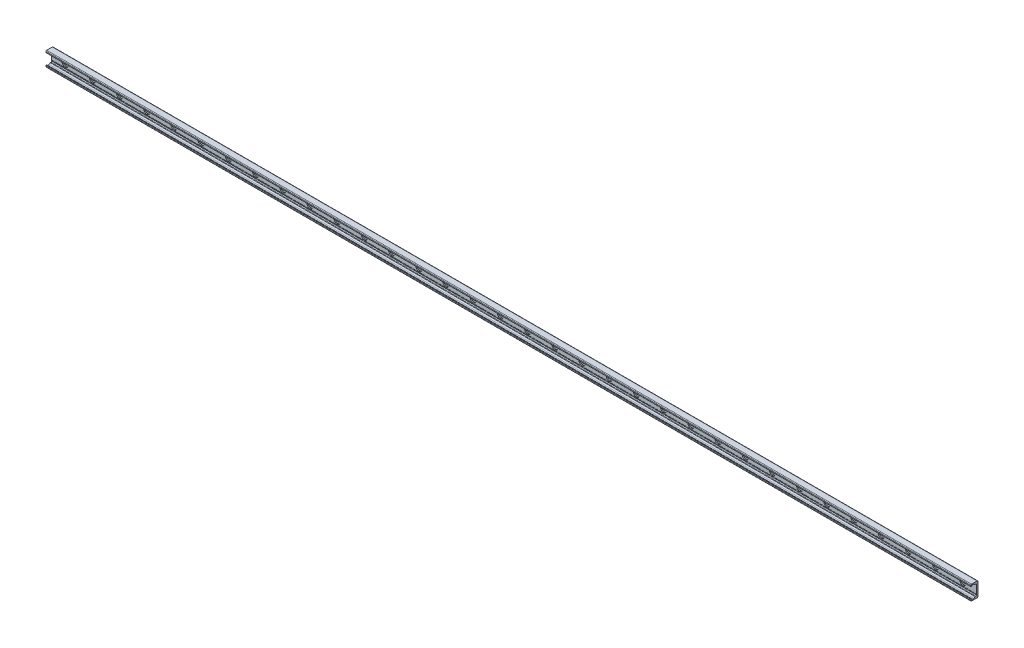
from build123d import *

# Parameters (mm, degrees)
BOSS_EXTRUDE1_DEPTH = 1360
SKETCH2_R           = 9
SKETCH2_R_2         = 4.5
CUT_EXTRUDE1_DEPTH  = 3.1
SKETCH2_2_R         = 4.5
CUT_EXTRUDE2_DEPTH  = 1361.270009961
LPATTERN1_COUNT     = 34
LPATTERN1_PITCH     = 80


with BuildPart() as part:
    # Sketch1 → Boss-Extrude1 (new, symmetric)
    with BuildSketch(Plane(origin=(0, 0, 0), x_dir=(0, 0, -1), z_dir=(1, 0, 0))):
        with BuildLine():
            Line((0, 0), (0, 19))
            ThreePointArc((0, 19), (-0.732233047, 20.767766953), (-2.5, 21.5))
            Line((-2.5, 21.5), (-19, 21.5))
            ThreePointArc((-19, 21.5), (-20.414213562, 20.914213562), (-21, 19.5))
            Line((-21, 19.5), (-21, 16.625057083))
            ThreePointArc((-21, 16.625057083), (-20.553251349, 15.888838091), (-19.693931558, 15.945160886))
            Line((-19.693931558, 15.945160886), (-16.794305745, 17.975500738))
            ThreePointArc((-16.794305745, 17.975500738), (-14.5, 18.69889256), (-12.205694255, 17.975500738))
            Line((-12.205694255, 17.975500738), (-8.829831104, 15.611695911))
            ThreePointArc((-8.829831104, 15.611695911), (-8.28408983, 15.342566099), (-7.682678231, 15.25))
            Line((-7.682678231, 15.25), (-6.5, 15.25))
            ThreePointArc((-6.5, 15.25), (-5.085786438, 14.664213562), (-4.5, 13.25))
            Line((-4.5, 13.25), (-4.5, -10.75))
            ThreePointArc((-4.5, -10.75), (-4.25, -11), (-4.5, -11.25))
            Line((-4.5, -11.25), (-4.5, -12.25))
            ThreePointArc((-4.5, -12.25), (-4.25, -12.5), (-4.5, -12.75))
            Line((-4.5, -12.75), (-4.5, -13.25))
            ThreePointArc((-4.5, -13.25), (-5.085786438, -14.664213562), (-6.5, -15.25))
            Line((-6.5, -15.25), (-7.682678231, -15.25))
            ThreePointArc((-7.682678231, -15.25), (-8.28408983, -15.342566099), (-8.829831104, -15.611695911))
            Line((-8.829831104, -15.611695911), (-12.205694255, -17.975500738))
            ThreePointArc((-12.205694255, -17.975500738), (-14.5, -18.69889256), (-16.794305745, -17.975500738))
            Line((-16.794305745, -17.975500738), (-19.693931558, -15.945160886))
            ThreePointArc((-19.693931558, -15.945160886), (-20.553251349, -15.888838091), (-21, -16.625057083))
            Line((-21, -16.625057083), (-21, -19.5))
            ThreePointArc((-21, -19.5), (-20.414213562, -20.914213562), (-19, -21.5))
            Line((-19, -21.5), (-2.5, -21.5))
            ThreePointArc((-2.5, -21.5), (-0.732233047, -20.767766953), (0, -19))
            Line((0, -19), (0, 0))
        make_face()
    extrude(amount=BOSS_EXTRUDE1_DEPTH, both=True)

    # Sketch2 → Cut-Extrude1 (cut)
    with BuildSketch(Plane.XY.offset(4.5)):
        with Locations((1320, 0)):
            Circle(SKETCH2_R)
        with Locations((1320, 0)):
            Circle(SKETCH2_R_2, mode=Mode.SUBTRACT)
    cut_extrude1 = extrude(amount=-CUT_EXTRUDE1_DEPTH, mode=Mode.SUBTRACT)

    # Sketch2_2 → Cut-Extrude2 (cut, through all)
    with BuildSketch(Plane.XY.offset(4.5)):
        with Locations((1320, 0)):
            Circle(SKETCH2_2_R)
    cut_extrude2 = extrude(amount=-CUT_EXTRUDE2_DEPTH, mode=Mode.SUBTRACT)

    # LPattern1: Cut-Extrude1, Cut-Extrude2 ×34
    with Locations(*[(-i * LPATTERN1_PITCH, 0, 0) for i in range(1, LPATTERN1_COUNT)]):
        add(cut_extrude1, mode=Mode.SUBTRACT)
        add(cut_extrude2, mode=Mode.SUBTRACT)


solid = part.part
